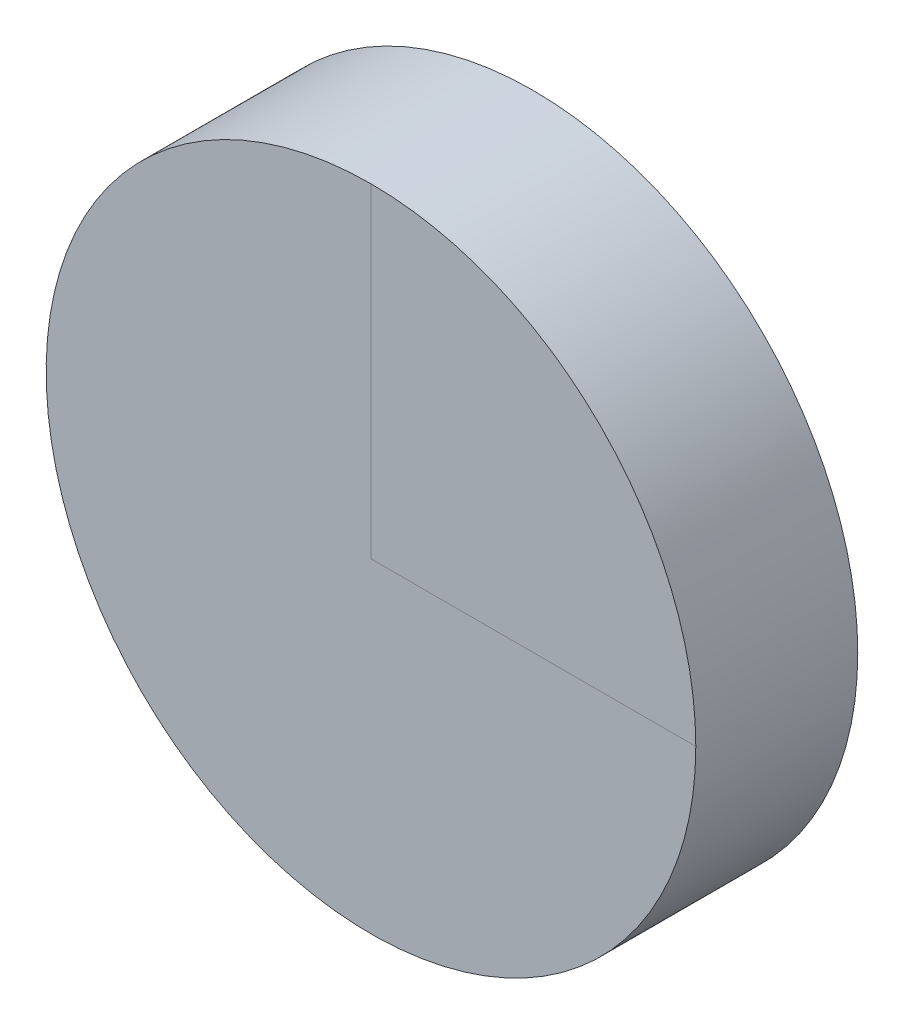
ISO-10303-21;
HEADER;
FILE_DESCRIPTION(('STEP AP214'),'2;1');
FILE_NAME('part.step','',(''),(''),'','','');
FILE_SCHEMA(('AUTOMOTIVE_DESIGN { 1 0 10303 214 1 1 1 1 }'));
ENDSEC;
DATA;
#1=APPLICATION_CONTEXT('core data for automotive mechanical design processes');
#2=APPLICATION_PROTOCOL_DEFINITION('international standard','automotive_design',2000,#1);
#3=PRODUCT_CONTEXT('',#1,'mechanical');
#4=PRODUCT('Part','Part','',(#3));
#5=PRODUCT_RELATED_PRODUCT_CATEGORY('part','',(#4));
#6=PRODUCT_DEFINITION_FORMATION('','',#4);
#7=PRODUCT_DEFINITION_CONTEXT('part definition',#1,'design');
#8=PRODUCT_DEFINITION('design','',#6,#7);
#9=PRODUCT_DEFINITION_SHAPE('','',#8);
#10=(LENGTH_UNIT() NAMED_UNIT(*) SI_UNIT(.MILLI.,.METRE.));
#11=(NAMED_UNIT(*) PLANE_ANGLE_UNIT() SI_UNIT($,.RADIAN.));
#12=(NAMED_UNIT(*) SI_UNIT($,.STERADIAN.) SOLID_ANGLE_UNIT());
#13=UNCERTAINTY_MEASURE_WITH_UNIT(LENGTH_MEASURE(1.E-05),#10,'distance_accuracy_value','');
#14=(GEOMETRIC_REPRESENTATION_CONTEXT(3) GLOBAL_UNCERTAINTY_ASSIGNED_CONTEXT((#13)) GLOBAL_UNIT_ASSIGNED_CONTEXT((#10,
#11,#12)) REPRESENTATION_CONTEXT('',''));
#15=CARTESIAN_POINT('',(0.,0.,0.));
#16=DIRECTION('',(0.,0.,1.));
#17=DIRECTION('',(1.,0.,0.));
#18=AXIS2_PLACEMENT_3D('',#15,#16,#17);
#19=CARTESIAN_POINT('',(0.,0.,0.));
#20=DIRECTION('',(0.,0.,1.));
#21=DIRECTION('',(1.,0.,0.));
#22=AXIS2_PLACEMENT_3D('',#19,#20,#21);
#23=PLANE('',#22);
#24=DIRECTION('',(-1.,0.,0.));
#25=VECTOR('',#24,1.);
#26=CARTESIAN_POINT('',(0.,0.,0.));
#27=LINE('',#26,#25);
#28=CARTESIAN_POINT('',(200.,0.,0.));
#29=VERTEX_POINT('',#28);
#30=CARTESIAN_POINT('',(0.,0.,0.));
#31=VERTEX_POINT('',#30);
#32=EDGE_CURVE('E11',#29,#31,#27,.T.);
#33=ORIENTED_EDGE('',*,*,#32,.F.);
#34=CARTESIAN_POINT('',(0.,0.,0.));
#35=DIRECTION('',(0.,0.,1.));
#36=DIRECTION('',(1.,0.,0.));
#37=AXIS2_PLACEMENT_3D('',#34,#35,#36);
#38=CIRCLE('',#37,200.);
#39=CARTESIAN_POINT('',(0.,200.,0.));
#40=VERTEX_POINT('',#39);
#41=EDGE_CURVE('E83',#40,#29,#38,.T.);
#42=ORIENTED_EDGE('',*,*,#41,.F.);
#43=DIRECTION('',(0.,1.,0.));
#44=VECTOR('',#43,1.);
#45=CARTESIAN_POINT('',(0.,0.,0.));
#46=LINE('',#45,#44);
#47=EDGE_CURVE('E36',#31,#40,#46,.T.);
#48=ORIENTED_EDGE('',*,*,#47,.F.);
#49=EDGE_LOOP('',(#33,#42,#48));
#50=FACE_BOUND('',#49,.T.);
#51=ADVANCED_FACE('F32',(#50),#23,.F.);
#52=CARTESIAN_POINT('',(0.,0.,99.724));
#53=DIRECTION('',(0.,0.,1.));
#54=DIRECTION('',(1.,0.,0.));
#55=AXIS2_PLACEMENT_3D('',#52,#53,#54);
#56=PLANE('',#55);
#57=CARTESIAN_POINT('',(0.,0.,99.724));
#58=DIRECTION('',(0.,0.,1.));
#59=DIRECTION('',(1.,0.,0.));
#60=AXIS2_PLACEMENT_3D('',#57,#58,#59);
#61=CIRCLE('',#60,200.);
#62=CARTESIAN_POINT('',(0.,200.,99.724));
#63=VERTEX_POINT('',#62);
#64=CARTESIAN_POINT('',(200.,0.,99.724));
#65=VERTEX_POINT('',#64);
#66=EDGE_CURVE('E73',#63,#65,#61,.T.);
#67=ORIENTED_EDGE('',*,*,#66,.T.);
#68=DIRECTION('',(-1.,0.,0.));
#69=VECTOR('',#68,1.);
#70=CARTESIAN_POINT('',(0.,0.,99.724));
#71=LINE('',#70,#69);
#72=CARTESIAN_POINT('',(0.,0.,99.724));
#73=VERTEX_POINT('',#72);
#74=EDGE_CURVE('E63',#65,#73,#71,.T.);
#75=ORIENTED_EDGE('',*,*,#74,.T.);
#76=DIRECTION('',(0.,1.,0.));
#77=VECTOR('',#76,1.);
#78=CARTESIAN_POINT('',(0.,0.,99.724));
#79=LINE('',#78,#77);
#80=EDGE_CURVE('E68',#73,#63,#79,.T.);
#81=ORIENTED_EDGE('',*,*,#80,.T.);
#82=EDGE_LOOP('',(#67,#75,#81));
#83=FACE_BOUND('',#82,.T.);
#84=ADVANCED_FACE('F74',(#83),#56,.T.);
#85=CARTESIAN_POINT('',(0.,0.,99.724));
#86=DIRECTION('',(0.,0.,-1.));
#87=DIRECTION('',(-1.,0.,0.));
#88=AXIS2_PLACEMENT_3D('',#85,#86,#87);
#89=CYLINDRICAL_SURFACE('',#88,200.);
#90=EDGE_CURVE('E67',#65,#63,#61,.T.);
#91=ORIENTED_EDGE('',*,*,#90,.F.);
#92=ORIENTED_EDGE('',*,*,#66,.F.);
#93=EDGE_LOOP('',(#91,#92));
#94=FACE_BOUND('',#93,.T.);
#95=EDGE_CURVE('E76',#29,#40,#38,.T.);
#96=ORIENTED_EDGE('',*,*,#95,.T.);
#97=ORIENTED_EDGE('',*,*,#41,.T.);
#98=EDGE_LOOP('',(#96,#97));
#99=FACE_BOUND('',#98,.T.);
#100=ADVANCED_FACE('F34',(#94,#99),#89,.T.);
#101=ORIENTED_EDGE('',*,*,#74,.F.);
#102=ORIENTED_EDGE('',*,*,#90,.T.);
#103=ORIENTED_EDGE('',*,*,#80,.F.);
#104=EDGE_LOOP('',(#101,#102,#103));
#105=FACE_BOUND('',#104,.T.);
#106=ADVANCED_FACE('F65',(#105),#56,.T.);
#107=ORIENTED_EDGE('',*,*,#95,.F.);
#108=ORIENTED_EDGE('',*,*,#32,.T.);
#109=ORIENTED_EDGE('',*,*,#47,.T.);
#110=EDGE_LOOP('',(#107,#108,#109));
#111=FACE_BOUND('',#110,.T.);
#112=ADVANCED_FACE('F86',(#111),#23,.F.);
#113=CLOSED_SHELL('',(#51,#84,#100,#106,#112));
#114=MANIFOLD_SOLID_BREP('B2',#113);
#115=ADVANCED_BREP_SHAPE_REPRESENTATION('',(#18,#114),#14);
#116=SHAPE_DEFINITION_REPRESENTATION(#9,#115);
ENDSEC;
END-ISO-10303-21;
